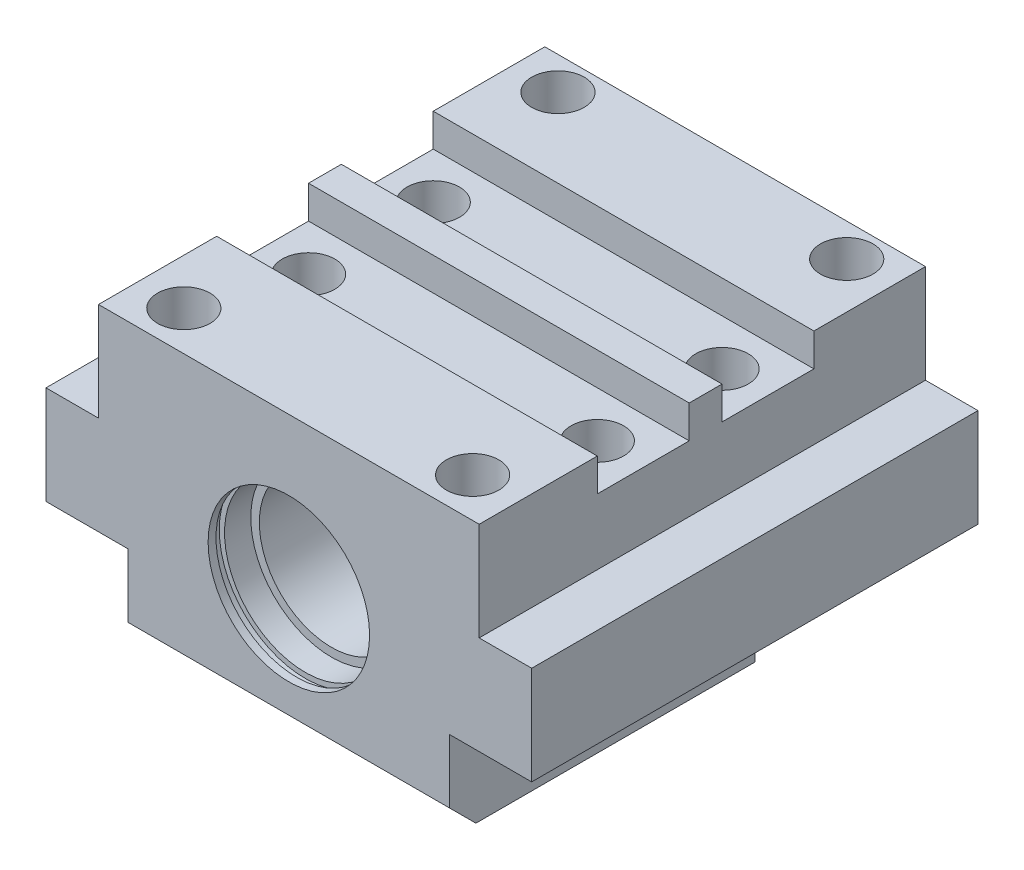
ISO-10303-21;
HEADER;
FILE_DESCRIPTION(('STEP AP214'),'2;1');
FILE_NAME('part.step','',(''),(''),'','','');
FILE_SCHEMA(('AUTOMOTIVE_DESIGN { 1 0 10303 214 1 1 1 1 }'));
ENDSEC;
DATA;
#1=APPLICATION_CONTEXT('core data for automotive mechanical design processes');
#2=APPLICATION_PROTOCOL_DEFINITION('international standard','automotive_design',2000,#1);
#3=PRODUCT_CONTEXT('',#1,'mechanical');
#4=PRODUCT('Part','Part','',(#3));
#5=PRODUCT_RELATED_PRODUCT_CATEGORY('part','',(#4));
#6=PRODUCT_DEFINITION_FORMATION('','',#4);
#7=PRODUCT_DEFINITION_CONTEXT('part definition',#1,'design');
#8=PRODUCT_DEFINITION('design','',#6,#7);
#9=PRODUCT_DEFINITION_SHAPE('','',#8);
#10=(LENGTH_UNIT() NAMED_UNIT(*) SI_UNIT(.MILLI.,.METRE.));
#11=(NAMED_UNIT(*) PLANE_ANGLE_UNIT() SI_UNIT($,.RADIAN.));
#12=(NAMED_UNIT(*) SI_UNIT($,.STERADIAN.) SOLID_ANGLE_UNIT());
#13=UNCERTAINTY_MEASURE_WITH_UNIT(LENGTH_MEASURE(1.E-05),#10,'distance_accuracy_value','');
#14=(GEOMETRIC_REPRESENTATION_CONTEXT(3) GLOBAL_UNCERTAINTY_ASSIGNED_CONTEXT((#13)) GLOBAL_UNIT_ASSIGNED_CONTEXT((#10,
#11,#12)) REPRESENTATION_CONTEXT('',''));
#15=CARTESIAN_POINT('',(0.,0.,0.));
#16=DIRECTION('',(0.,0.,1.));
#17=DIRECTION('',(1.,0.,0.));
#18=AXIS2_PLACEMENT_3D('',#15,#16,#17);
#19=CARTESIAN_POINT('',(-29.,0.,34.));
#20=DIRECTION('',(0.,-1.,0.));
#21=DIRECTION('',(1.,0.,0.));
#22=AXIS2_PLACEMENT_3D('',#19,#20,#21);
#23=PLANE('',#22);
#24=CARTESIAN_POINT('',(22.,0.,28.));
#25=DIRECTION('',(0.,1.,0.));
#26=DIRECTION('',(-1.,0.,0.));
#27=AXIS2_PLACEMENT_3D('',#24,#25,#26);
#28=CIRCLE('',#27,4.);
#29=CARTESIAN_POINT('',(18.,0.,28.));
#30=VERTEX_POINT('',#29);
#31=EDGE_CURVE('E616',#30,#30,#28,.T.);
#32=ORIENTED_EDGE('',*,*,#31,.F.);
#33=EDGE_LOOP('',(#32));
#34=FACE_BOUND('',#33,.T.);
#35=CARTESIAN_POINT('',(-22.,0.,28.));
#36=DIRECTION('',(0.,1.,0.));
#37=DIRECTION('',(-1.,0.,0.));
#38=AXIS2_PLACEMENT_3D('',#35,#36,#37);
#39=CIRCLE('',#38,4.);
#40=CARTESIAN_POINT('',(-26.,0.,28.));
#41=VERTEX_POINT('',#40);
#42=EDGE_CURVE('E622',#41,#41,#39,.T.);
#43=ORIENTED_EDGE('',*,*,#42,.F.);
#44=EDGE_LOOP('',(#43));
#45=FACE_BOUND('',#44,.T.);
#46=DIRECTION('',(0.,0.,-1.));
#47=VECTOR('',#46,1.);
#48=CARTESIAN_POINT('',(-29.,0.,34.));
#49=LINE('',#48,#47);
#50=CARTESIAN_POINT('',(-29.,0.,16.));
#51=VERTEX_POINT('',#50);
#52=CARTESIAN_POINT('',(-29.,0.,34.));
#53=VERTEX_POINT('',#52);
#54=EDGE_CURVE('E201',#51,#53,#49,.F.);
#55=ORIENTED_EDGE('',*,*,#54,.T.);
#56=DIRECTION('',(1.,0.,0.));
#57=VECTOR('',#56,1.);
#58=CARTESIAN_POINT('',(-29.,0.,34.));
#59=LINE('',#58,#57);
#60=CARTESIAN_POINT('',(29.,0.,34.));
#61=VERTEX_POINT('',#60);
#62=EDGE_CURVE('E258',#61,#53,#59,.F.);
#63=ORIENTED_EDGE('',*,*,#62,.F.);
#64=DIRECTION('',(0.,0.,-1.));
#65=VECTOR('',#64,1.);
#66=CARTESIAN_POINT('',(29.,0.,34.));
#67=LINE('',#66,#65);
#68=CARTESIAN_POINT('',(29.,0.,16.));
#69=VERTEX_POINT('',#68);
#70=EDGE_CURVE('E219',#69,#61,#67,.F.);
#71=ORIENTED_EDGE('',*,*,#70,.F.);
#72=DIRECTION('',(1.,0.,0.));
#73=VECTOR('',#72,1.);
#74=CARTESIAN_POINT('',(-29.,0.,16.));
#75=LINE('',#74,#73);
#76=EDGE_CURVE('E221',#69,#51,#75,.F.);
#77=ORIENTED_EDGE('',*,*,#76,.T.);
#78=EDGE_LOOP('',(#55,#63,#71,#77));
#79=FACE_BOUND('',#78,.T.);
#80=ADVANCED_FACE('F17',(#34,#45,#79),#23,.F.);
#81=CARTESIAN_POINT('',(0.,0.,34.));
#82=DIRECTION('',(0.,0.,-1.));
#83=DIRECTION('',(-1.,0.,0.));
#84=AXIS2_PLACEMENT_3D('',#81,#82,#83);
#85=PLANE('',#84);
#86=DIRECTION('',(-1.,0.,0.));
#87=VECTOR('',#86,1.);
#88=CARTESIAN_POINT('',(0.,-15.,34.));
#89=LINE('',#88,#87);
#90=CARTESIAN_POINT('',(29.,-15.,34.));
#91=VERTEX_POINT('',#90);
#92=CARTESIAN_POINT('',(37.,-15.,34.));
#93=VERTEX_POINT('',#92);
#94=EDGE_CURVE('E237',#91,#93,#89,.F.);
#95=ORIENTED_EDGE('',*,*,#94,.F.);
#96=DIRECTION('',(0.,-1.,0.));
#97=VECTOR('',#96,1.);
#98=CARTESIAN_POINT('',(29.,0.,34.));
#99=LINE('',#98,#97);
#100=EDGE_CURVE('E302',#91,#61,#99,.F.);
#101=ORIENTED_EDGE('',*,*,#100,.T.);
#102=ORIENTED_EDGE('',*,*,#62,.T.);
#103=DIRECTION('',(0.,-1.,0.));
#104=VECTOR('',#103,1.);
#105=CARTESIAN_POINT('',(-29.,0.,34.));
#106=LINE('',#105,#104);
#107=CARTESIAN_POINT('',(-29.,-15.,34.));
#108=VERTEX_POINT('',#107);
#109=EDGE_CURVE('E293',#108,#53,#106,.F.);
#110=ORIENTED_EDGE('',*,*,#109,.F.);
#111=DIRECTION('',(1.,0.,0.));
#112=VECTOR('',#111,1.);
#113=CARTESIAN_POINT('',(-37.,-15.,34.));
#114=LINE('',#113,#112);
#115=CARTESIAN_POINT('',(-37.,-15.,34.));
#116=VERTEX_POINT('',#115);
#117=EDGE_CURVE('E251',#108,#116,#114,.F.);
#118=ORIENTED_EDGE('',*,*,#117,.T.);
#119=DIRECTION('',(0.,1.,0.));
#120=VECTOR('',#119,1.);
#121=CARTESIAN_POINT('',(-37.,-30.,34.));
#122=LINE('',#121,#120);
#123=CARTESIAN_POINT('',(-37.,-30.,34.));
#124=VERTEX_POINT('',#123);
#125=EDGE_CURVE('E296',#116,#124,#122,.F.);
#126=ORIENTED_EDGE('',*,*,#125,.T.);
#127=DIRECTION('',(1.,0.,0.));
#128=VECTOR('',#127,1.);
#129=CARTESIAN_POINT('',(0.,-30.,34.));
#130=LINE('',#129,#128);
#131=CARTESIAN_POINT('',(-24.5,-30.,34.));
#132=VERTEX_POINT('',#131);
#133=EDGE_CURVE('E254',#132,#124,#130,.F.);
#134=ORIENTED_EDGE('',*,*,#133,.F.);
#135=DIRECTION('',(0.,1.,0.));
#136=VECTOR('',#135,1.);
#137=CARTESIAN_POINT('',(-24.5,-43.7,34.));
#138=LINE('',#137,#136);
#139=CARTESIAN_POINT('',(-24.5,-39.7,34.));
#140=VERTEX_POINT('',#139);
#141=EDGE_CURVE('E299',#132,#140,#138,.F.);
#142=ORIENTED_EDGE('',*,*,#141,.T.);
#143=DIRECTION('',(1.,0.,0.));
#144=VECTOR('',#143,1.);
#145=CARTESIAN_POINT('',(0.,-39.7,34.));
#146=LINE('',#145,#144);
#147=CARTESIAN_POINT('',(24.5,-39.7,34.));
#148=VERTEX_POINT('',#147);
#149=EDGE_CURVE('E182',#140,#148,#146,.T.);
#150=ORIENTED_EDGE('',*,*,#149,.T.);
#151=DIRECTION('',(0.,1.,0.));
#152=VECTOR('',#151,1.);
#153=CARTESIAN_POINT('',(24.5,0.,34.));
#154=LINE('',#153,#152);
#155=CARTESIAN_POINT('',(24.5,-30.,34.));
#156=VERTEX_POINT('',#155);
#157=EDGE_CURVE('E192',#156,#148,#154,.F.);
#158=ORIENTED_EDGE('',*,*,#157,.F.);
#159=DIRECTION('',(-1.,0.,0.));
#160=VECTOR('',#159,1.);
#161=CARTESIAN_POINT('',(37.,-30.,34.));
#162=LINE('',#161,#160);
#163=CARTESIAN_POINT('',(37.,-30.,34.));
#164=VERTEX_POINT('',#163);
#165=EDGE_CURVE('E239',#156,#164,#162,.F.);
#166=ORIENTED_EDGE('',*,*,#165,.T.);
#167=DIRECTION('',(0.,1.,0.));
#168=VECTOR('',#167,1.);
#169=CARTESIAN_POINT('',(37.,0.,34.));
#170=LINE('',#169,#168);
#171=EDGE_CURVE('E305',#93,#164,#170,.F.);
#172=ORIENTED_EDGE('',*,*,#171,.F.);
#173=EDGE_LOOP('',(#95,#101,#102,#110,#118,#126,#134,#142,#150,#158,#166,#172));
#174=FACE_BOUND('',#173,.T.);
#175=CARTESIAN_POINT('',(0.,-23.,34.));
#176=DIRECTION('',(0.,0.,-1.));
#177=DIRECTION('',(-1.,0.,0.));
#178=AXIS2_PLACEMENT_3D('',#175,#176,#177);
#179=CIRCLE('',#178,12.3);
#180=CARTESIAN_POINT('',(-12.3,-23.,34.));
#181=VERTEX_POINT('',#180);
#182=EDGE_CURVE('E11',#181,#181,#179,.T.);
#183=ORIENTED_EDGE('',*,*,#182,.T.);
#184=EDGE_LOOP('',(#183));
#185=FACE_BOUND('',#184,.T.);
#186=ADVANCED_FACE('F465',(#174,#185),#85,.F.);
#187=CARTESIAN_POINT('',(-29.,0.,34.));
#188=DIRECTION('',(0.,-1.,0.));
#189=DIRECTION('',(1.,0.,0.));
#190=AXIS2_PLACEMENT_3D('',#187,#188,#189);
#191=PLANE('',#190);
#192=CARTESIAN_POINT('',(-22.,0.,-29.));
#193=DIRECTION('',(0.,1.,0.));
#194=DIRECTION('',(-1.,0.,0.));
#195=AXIS2_PLACEMENT_3D('',#192,#193,#194);
#196=CIRCLE('',#195,4.);
#197=CARTESIAN_POINT('',(-26.,0.,-29.));
#198=VERTEX_POINT('',#197);
#199=EDGE_CURVE('E654',#198,#198,#196,.T.);
#200=ORIENTED_EDGE('',*,*,#199,.F.);
#201=EDGE_LOOP('',(#200));
#202=FACE_BOUND('',#201,.T.);
#203=CARTESIAN_POINT('',(22.,0.,-29.));
#204=DIRECTION('',(0.,1.,0.));
#205=DIRECTION('',(-1.,0.,0.));
#206=AXIS2_PLACEMENT_3D('',#203,#204,#205);
#207=CIRCLE('',#206,4.);
#208=CARTESIAN_POINT('',(18.,0.,-29.));
#209=VERTEX_POINT('',#208);
#210=EDGE_CURVE('E661',#209,#209,#207,.T.);
#211=ORIENTED_EDGE('',*,*,#210,.F.);
#212=EDGE_LOOP('',(#211));
#213=FACE_BOUND('',#212,.T.);
#214=DIRECTION('',(0.,0.,-1.));
#215=VECTOR('',#214,1.);
#216=CARTESIAN_POINT('',(29.,0.,34.));
#217=LINE('',#216,#215);
#218=CARTESIAN_POINT('',(29.,0.,-34.));
#219=VERTEX_POINT('',#218);
#220=CARTESIAN_POINT('',(29.,0.,-17.));
#221=VERTEX_POINT('',#220);
#222=EDGE_CURVE('E346',#219,#221,#217,.F.);
#223=ORIENTED_EDGE('',*,*,#222,.F.);
#224=DIRECTION('',(1.,0.,0.));
#225=VECTOR('',#224,1.);
#226=CARTESIAN_POINT('',(-29.,0.,-34.));
#227=LINE('',#226,#225);
#228=CARTESIAN_POINT('',(-29.,0.,-34.));
#229=VERTEX_POINT('',#228);
#230=EDGE_CURVE('E232',#229,#219,#227,.T.);
#231=ORIENTED_EDGE('',*,*,#230,.F.);
#232=DIRECTION('',(0.,0.,-1.));
#233=VECTOR('',#232,1.);
#234=CARTESIAN_POINT('',(-29.,0.,34.));
#235=LINE('',#234,#233);
#236=CARTESIAN_POINT('',(-29.,0.,-17.));
#237=VERTEX_POINT('',#236);
#238=EDGE_CURVE('E207',#229,#237,#235,.F.);
#239=ORIENTED_EDGE('',*,*,#238,.T.);
#240=DIRECTION('',(-1.,0.,0.));
#241=VECTOR('',#240,1.);
#242=CARTESIAN_POINT('',(-29.,0.,-17.));
#243=LINE('',#242,#241);
#244=EDGE_CURVE('E229',#237,#221,#243,.F.);
#245=ORIENTED_EDGE('',*,*,#244,.T.);
#246=EDGE_LOOP('',(#223,#231,#239,#245));
#247=FACE_BOUND('',#246,.T.);
#248=ADVANCED_FACE('F433',(#202,#213,#247),#191,.F.);
#249=CARTESIAN_POINT('',(24.5,-43.7,34.));
#250=DIRECTION('',(0.,1.,0.));
#251=DIRECTION('',(-1.,0.,0.));
#252=AXIS2_PLACEMENT_3D('',#249,#250,#251);
#253=PLANE('',#252);
#254=DIRECTION('',(0.,0.,-1.));
#255=VECTOR('',#254,1.);
#256=CARTESIAN_POINT('',(-24.5,-43.7,34.));
#257=LINE('',#256,#255);
#258=CARTESIAN_POINT('',(-24.5,-43.7,-12.5));
#259=VERTEX_POINT('',#258);
#260=CARTESIAN_POINT('',(-24.5,-43.7,30.));
#261=VERTEX_POINT('',#260);
#262=EDGE_CURVE('E214',#259,#261,#257,.F.);
#263=ORIENTED_EDGE('',*,*,#262,.F.);
#264=DIRECTION('',(1.,0.,0.));
#265=VECTOR('',#264,1.);
#266=CARTESIAN_POINT('',(24.5,-43.7,-12.5));
#267=LINE('',#266,#265);
#268=CARTESIAN_POINT('',(24.5,-43.7,-12.5));
#269=VERTEX_POINT('',#268);
#270=EDGE_CURVE('E32',#269,#259,#267,.F.);
#271=ORIENTED_EDGE('',*,*,#270,.F.);
#272=DIRECTION('',(0.,0.,-1.));
#273=VECTOR('',#272,1.);
#274=CARTESIAN_POINT('',(24.5,-43.7,34.));
#275=LINE('',#274,#273);
#276=CARTESIAN_POINT('',(24.5,-43.7,30.));
#277=VERTEX_POINT('',#276);
#278=EDGE_CURVE('E184',#269,#277,#275,.F.);
#279=ORIENTED_EDGE('',*,*,#278,.T.);
#280=DIRECTION('',(-1.,0.,0.));
#281=VECTOR('',#280,1.);
#282=CARTESIAN_POINT('',(24.5,-43.7,30.));
#283=LINE('',#282,#281);
#284=EDGE_CURVE('E173',#261,#277,#283,.F.);
#285=ORIENTED_EDGE('',*,*,#284,.F.);
#286=EDGE_LOOP('',(#263,#271,#279,#285));
#287=FACE_BOUND('',#286,.T.);
#288=ADVANCED_FACE('F185',(#287),#253,.F.);
#289=CARTESIAN_POINT('',(24.5,-42.,-12.5));
#290=DIRECTION('',(0.,0.,1.));
#291=DIRECTION('',(1.,0.,0.));
#292=AXIS2_PLACEMENT_3D('',#289,#290,#291);
#293=PLANE('',#292);
#294=DIRECTION('',(1.,0.,0.));
#295=VECTOR('',#294,1.);
#296=CARTESIAN_POINT('',(24.5,-42.,-12.5));
#297=LINE('',#296,#295);
#298=CARTESIAN_POINT('',(24.5,-42.,-12.5));
#299=VERTEX_POINT('',#298);
#300=CARTESIAN_POINT('',(-24.5,-42.,-12.5));
#301=VERTEX_POINT('',#300);
#302=EDGE_CURVE('E40',#299,#301,#297,.F.);
#303=ORIENTED_EDGE('',*,*,#302,.F.);
#304=DIRECTION('',(0.,-1.,0.));
#305=VECTOR('',#304,1.);
#306=CARTESIAN_POINT('',(24.5,-42.,-12.5));
#307=LINE('',#306,#305);
#308=EDGE_CURVE('E321',#269,#299,#307,.F.);
#309=ORIENTED_EDGE('',*,*,#308,.F.);
#310=ORIENTED_EDGE('',*,*,#270,.T.);
#311=DIRECTION('',(0.,1.,0.));
#312=VECTOR('',#311,1.);
#313=CARTESIAN_POINT('',(-24.5,-42.,-12.5));
#314=LINE('',#313,#312);
#315=EDGE_CURVE('E269',#301,#259,#314,.F.);
#316=ORIENTED_EDGE('',*,*,#315,.F.);
#317=EDGE_LOOP('',(#303,#309,#310,#316));
#318=FACE_BOUND('',#317,.T.);
#319=ADVANCED_FACE('F516',(#318),#293,.F.);
#320=CARTESIAN_POINT('',(-29.,0.,34.));
#321=DIRECTION('',(0.,-1.,0.));
#322=DIRECTION('',(1.,0.,0.));
#323=AXIS2_PLACEMENT_3D('',#320,#321,#322);
#324=PLANE('',#323);
#325=DIRECTION('',(0.,0.,-1.));
#326=VECTOR('',#325,1.);
#327=CARTESIAN_POINT('',(29.,0.,34.));
#328=LINE('',#327,#326);
#329=CARTESIAN_POINT('',(29.,0.,-3.));
#330=VERTEX_POINT('',#329);
#331=CARTESIAN_POINT('',(29.,0.,2.));
#332=VERTEX_POINT('',#331);
#333=EDGE_CURVE('E181',#330,#332,#328,.F.);
#334=ORIENTED_EDGE('',*,*,#333,.F.);
#335=DIRECTION('',(-1.,0.,0.));
#336=VECTOR('',#335,1.);
#337=CARTESIAN_POINT('',(-29.,0.,-3.));
#338=LINE('',#337,#336);
#339=CARTESIAN_POINT('',(-29.,0.,-3.));
#340=VERTEX_POINT('',#339);
#341=EDGE_CURVE('E227',#340,#330,#338,.F.);
#342=ORIENTED_EDGE('',*,*,#341,.F.);
#343=DIRECTION('',(0.,0.,-1.));
#344=VECTOR('',#343,1.);
#345=CARTESIAN_POINT('',(-29.,0.,34.));
#346=LINE('',#345,#344);
#347=CARTESIAN_POINT('',(-29.,0.,2.));
#348=VERTEX_POINT('',#347);
#349=EDGE_CURVE('E204',#340,#348,#346,.F.);
#350=ORIENTED_EDGE('',*,*,#349,.T.);
#351=DIRECTION('',(-1.,0.,0.));
#352=VECTOR('',#351,1.);
#353=CARTESIAN_POINT('',(-29.,0.,2.));
#354=LINE('',#353,#352);
#355=EDGE_CURVE('E224',#348,#332,#354,.F.);
#356=ORIENTED_EDGE('',*,*,#355,.T.);
#357=EDGE_LOOP('',(#334,#342,#350,#356));
#358=FACE_BOUND('',#357,.T.);
#359=ADVANCED_FACE('F449',(#358),#324,.F.);
#360=CARTESIAN_POINT('',(0.,-39.7,34.));
#361=DIRECTION('',(0.,0.70710678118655,-0.707106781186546));
#362=DIRECTION('',(0.,0.707106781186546,0.70710678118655));
#363=AXIS2_PLACEMENT_3D('',#360,#361,#362);
#364=PLANE('',#363);
#365=ORIENTED_EDGE('',*,*,#149,.F.);
#366=DIRECTION('',(0.,-0.707106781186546,-0.70710678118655));
#367=VECTOR('',#366,1.);
#368=CARTESIAN_POINT('',(-24.5,-39.7,34.));
#369=LINE('',#368,#367);
#370=EDGE_CURVE('E179',#261,#140,#369,.F.);
#371=ORIENTED_EDGE('',*,*,#370,.F.);
#372=ORIENTED_EDGE('',*,*,#284,.T.);
#373=DIRECTION('',(0.,0.707106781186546,0.70710678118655));
#374=VECTOR('',#373,1.);
#375=CARTESIAN_POINT('',(24.5,-39.7,34.));
#376=LINE('',#375,#374);
#377=EDGE_CURVE('E177',#148,#277,#376,.F.);
#378=ORIENTED_EDGE('',*,*,#377,.F.);
#379=EDGE_LOOP('',(#365,#371,#372,#378));
#380=FACE_BOUND('',#379,.T.);
#381=ADVANCED_FACE('F175',(#380),#364,.F.);
#382=CARTESIAN_POINT('',(-29.,-5.,-3.));
#383=DIRECTION('',(0.,0.,1.));
#384=DIRECTION('',(1.,0.,0.));
#385=AXIS2_PLACEMENT_3D('',#382,#383,#384);
#386=PLANE('',#385);
#387=DIRECTION('',(1.,0.,0.));
#388=VECTOR('',#387,1.);
#389=CARTESIAN_POINT('',(0.,-5.,-3.));
#390=LINE('',#389,#388);
#391=CARTESIAN_POINT('',(-29.,-5.,-3.));
#392=VERTEX_POINT('',#391);
#393=CARTESIAN_POINT('',(29.,-5.,-2.99999999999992));
#394=VERTEX_POINT('',#393);
#395=EDGE_CURVE('E390',#392,#394,#390,.T.);
#396=ORIENTED_EDGE('',*,*,#395,.F.);
#397=DIRECTION('',(0.,-1.,0.));
#398=VECTOR('',#397,1.);
#399=CARTESIAN_POINT('',(-29.,-15.,-3.));
#400=LINE('',#399,#398);
#401=EDGE_CURVE('E284',#392,#340,#400,.F.);
#402=ORIENTED_EDGE('',*,*,#401,.T.);
#403=ORIENTED_EDGE('',*,*,#341,.T.);
#404=DIRECTION('',(0.,-1.,0.));
#405=VECTOR('',#404,1.);
#406=CARTESIAN_POINT('',(29.,-5.,-2.99999999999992));
#407=LINE('',#406,#405);
#408=EDGE_CURVE('E315',#394,#330,#407,.F.);
#409=ORIENTED_EDGE('',*,*,#408,.F.);
#410=EDGE_LOOP('',(#396,#402,#403,#409));
#411=FACE_BOUND('',#410,.T.);
#412=ADVANCED_FACE('F445',(#411),#386,.F.);
#413=CARTESIAN_POINT('',(-29.,-5.,2.));
#414=DIRECTION('',(0.,0.,-1.));
#415=DIRECTION('',(-1.,0.,0.));
#416=AXIS2_PLACEMENT_3D('',#413,#414,#415);
#417=PLANE('',#416);
#418=DIRECTION('',(1.,0.,0.));
#419=VECTOR('',#418,1.);
#420=CARTESIAN_POINT('',(0.,-5.,2.));
#421=LINE('',#420,#419);
#422=CARTESIAN_POINT('',(29.,-5.,2.00000000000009));
#423=VERTEX_POINT('',#422);
#424=CARTESIAN_POINT('',(-29.,-5.,2.));
#425=VERTEX_POINT('',#424);
#426=EDGE_CURVE('E396',#423,#425,#421,.F.);
#427=ORIENTED_EDGE('',*,*,#426,.F.);
#428=DIRECTION('',(0.,-1.,0.));
#429=VECTOR('',#428,1.);
#430=CARTESIAN_POINT('',(29.,0.,2.));
#431=LINE('',#430,#429);
#432=EDGE_CURVE('E312',#423,#332,#431,.F.);
#433=ORIENTED_EDGE('',*,*,#432,.T.);
#434=ORIENTED_EDGE('',*,*,#355,.F.);
#435=DIRECTION('',(0.,-1.,0.));
#436=VECTOR('',#435,1.);
#437=CARTESIAN_POINT('',(-29.,-5.,2.));
#438=LINE('',#437,#436);
#439=EDGE_CURVE('E287',#425,#348,#438,.F.);
#440=ORIENTED_EDGE('',*,*,#439,.F.);
#441=EDGE_LOOP('',(#427,#433,#434,#440));
#442=FACE_BOUND('',#441,.T.);
#443=ADVANCED_FACE('F452',(#442),#417,.F.);
#444=CARTESIAN_POINT('',(-29.,-5.,16.));
#445=DIRECTION('',(0.,0.,1.));
#446=DIRECTION('',(1.,0.,0.));
#447=AXIS2_PLACEMENT_3D('',#444,#445,#446);
#448=PLANE('',#447);
#449=DIRECTION('',(1.,0.,0.));
#450=VECTOR('',#449,1.);
#451=CARTESIAN_POINT('',(0.,-5.,16.));
#452=LINE('',#451,#450);
#453=CARTESIAN_POINT('',(-29.,-5.,16.));
#454=VERTEX_POINT('',#453);
#455=CARTESIAN_POINT('',(29.,-5.,16.));
#456=VERTEX_POINT('',#455);
#457=EDGE_CURVE('E394',#454,#456,#452,.T.);
#458=ORIENTED_EDGE('',*,*,#457,.F.);
#459=DIRECTION('',(0.,-1.,0.));
#460=VECTOR('',#459,1.);
#461=CARTESIAN_POINT('',(-29.,-15.,16.));
#462=LINE('',#461,#460);
#463=EDGE_CURVE('E290',#454,#51,#462,.F.);
#464=ORIENTED_EDGE('',*,*,#463,.T.);
#465=ORIENTED_EDGE('',*,*,#76,.F.);
#466=DIRECTION('',(0.,-1.,0.));
#467=VECTOR('',#466,1.);
#468=CARTESIAN_POINT('',(29.,-5.,16.));
#469=LINE('',#468,#467);
#470=EDGE_CURVE('E309',#456,#69,#469,.F.);
#471=ORIENTED_EDGE('',*,*,#470,.F.);
#472=EDGE_LOOP('',(#458,#464,#465,#471));
#473=FACE_BOUND('',#472,.T.);
#474=ADVANCED_FACE('F459',(#473),#448,.F.);
#475=CARTESIAN_POINT('',(-29.,-5.,-17.));
#476=DIRECTION('',(0.,0.,-1.));
#477=DIRECTION('',(-1.,0.,0.));
#478=AXIS2_PLACEMENT_3D('',#475,#476,#477);
#479=PLANE('',#478);
#480=DIRECTION('',(1.,0.,0.));
#481=VECTOR('',#480,1.);
#482=CARTESIAN_POINT('',(0.,-5.,-17.));
#483=LINE('',#482,#481);
#484=CARTESIAN_POINT('',(29.,-5.,-17.));
#485=VERTEX_POINT('',#484);
#486=CARTESIAN_POINT('',(-29.,-5.,-17.));
#487=VERTEX_POINT('',#486);
#488=EDGE_CURVE('E392',#485,#487,#483,.F.);
#489=ORIENTED_EDGE('',*,*,#488,.F.);
#490=DIRECTION('',(0.,-1.,0.));
#491=VECTOR('',#490,1.);
#492=CARTESIAN_POINT('',(29.,0.,-17.));
#493=LINE('',#492,#491);
#494=EDGE_CURVE('E318',#485,#221,#493,.F.);
#495=ORIENTED_EDGE('',*,*,#494,.T.);
#496=ORIENTED_EDGE('',*,*,#244,.F.);
#497=DIRECTION('',(0.,-1.,0.));
#498=VECTOR('',#497,1.);
#499=CARTESIAN_POINT('',(-29.,-5.,-17.));
#500=LINE('',#499,#498);
#501=EDGE_CURVE('E281',#487,#237,#500,.F.);
#502=ORIENTED_EDGE('',*,*,#501,.F.);
#503=EDGE_LOOP('',(#489,#495,#496,#502));
#504=FACE_BOUND('',#503,.T.);
#505=ADVANCED_FACE('F437',(#504),#479,.F.);
#506=CARTESIAN_POINT('',(-29.,-15.,34.));
#507=DIRECTION('',(1.,0.,0.));
#508=DIRECTION('',(0.,0.,-1.));
#509=AXIS2_PLACEMENT_3D('',#506,#507,#508);
#510=PLANE('',#509);
#511=DIRECTION('',(0.,0.,-1.));
#512=VECTOR('',#511,1.);
#513=CARTESIAN_POINT('',(-29.,-5.,34.));
#514=LINE('',#513,#512);
#515=EDGE_CURVE('E386',#487,#392,#514,.F.);
#516=ORIENTED_EDGE('',*,*,#515,.F.);
#517=ORIENTED_EDGE('',*,*,#501,.T.);
#518=ORIENTED_EDGE('',*,*,#238,.F.);
#519=DIRECTION('',(0.,1.,0.));
#520=VECTOR('',#519,1.);
#521=CARTESIAN_POINT('',(-29.,-15.,-34.));
#522=LINE('',#521,#520);
#523=CARTESIAN_POINT('',(-29.,-15.,-34.));
#524=VERTEX_POINT('',#523);
#525=EDGE_CURVE('E278',#524,#229,#522,.T.);
#526=ORIENTED_EDGE('',*,*,#525,.F.);
#527=DIRECTION('',(0.,0.,-1.));
#528=VECTOR('',#527,1.);
#529=CARTESIAN_POINT('',(-29.,-15.,34.));
#530=LINE('',#529,#528);
#531=EDGE_CURVE('E381',#108,#524,#530,.T.);
#532=ORIENTED_EDGE('',*,*,#531,.F.);
#533=ORIENTED_EDGE('',*,*,#109,.T.);
#534=ORIENTED_EDGE('',*,*,#54,.F.);
#535=ORIENTED_EDGE('',*,*,#463,.F.);
#536=DIRECTION('',(0.,0.,-1.));
#537=VECTOR('',#536,1.);
#538=CARTESIAN_POINT('',(-29.,-5.,34.));
#539=LINE('',#538,#537);
#540=EDGE_CURVE('E383',#425,#454,#539,.F.);
#541=ORIENTED_EDGE('',*,*,#540,.F.);
#542=ORIENTED_EDGE('',*,*,#439,.T.);
#543=ORIENTED_EDGE('',*,*,#349,.F.);
#544=ORIENTED_EDGE('',*,*,#401,.F.);
#545=EDGE_LOOP('',(#516,#517,#518,#526,#532,#533,#534,#535,#541,#542,#543,#544));
#546=FACE_BOUND('',#545,.T.);
#547=ADVANCED_FACE('F478',(#546),#510,.F.);
#548=CARTESIAN_POINT('',(-37.,-15.,34.));
#549=DIRECTION('',(0.,-1.,0.));
#550=DIRECTION('',(0.,0.,-1.));
#551=AXIS2_PLACEMENT_3D('',#548,#549,#550);
#552=PLANE('',#551);
#553=ORIENTED_EDGE('',*,*,#531,.T.);
#554=DIRECTION('',(-1.,0.,0.));
#555=VECTOR('',#554,1.);
#556=CARTESIAN_POINT('',(0.,-15.,-34.));
#557=LINE('',#556,#555);
#558=CARTESIAN_POINT('',(-37.,-15.,-34.));
#559=VERTEX_POINT('',#558);
#560=EDGE_CURVE('E248',#524,#559,#557,.T.);
#561=ORIENTED_EDGE('',*,*,#560,.T.);
#562=DIRECTION('',(0.,0.,1.));
#563=VECTOR('',#562,1.);
#564=CARTESIAN_POINT('',(-37.,-15.,34.));
#565=LINE('',#564,#563);
#566=EDGE_CURVE('E210',#116,#559,#565,.F.);
#567=ORIENTED_EDGE('',*,*,#566,.F.);
#568=ORIENTED_EDGE('',*,*,#117,.F.);
#569=EDGE_LOOP('',(#553,#561,#567,#568));
#570=FACE_BOUND('',#569,.T.);
#571=ADVANCED_FACE('F475',(#570),#552,.F.);
#572=CARTESIAN_POINT('',(-37.,-30.,34.));
#573=DIRECTION('',(1.,0.,0.));
#574=DIRECTION('',(0.,0.,-1.));
#575=AXIS2_PLACEMENT_3D('',#572,#573,#574);
#576=PLANE('',#575);
#577=ORIENTED_EDGE('',*,*,#566,.T.);
#578=DIRECTION('',(0.,1.,0.));
#579=VECTOR('',#578,1.);
#580=CARTESIAN_POINT('',(-37.,-30.,-34.));
#581=LINE('',#580,#579);
#582=CARTESIAN_POINT('',(-37.,-30.,-34.));
#583=VERTEX_POINT('',#582);
#584=EDGE_CURVE('E275',#583,#559,#581,.T.);
#585=ORIENTED_EDGE('',*,*,#584,.F.);
#586=DIRECTION('',(0.,0.,1.));
#587=VECTOR('',#586,1.);
#588=CARTESIAN_POINT('',(-37.,-30.,34.));
#589=LINE('',#588,#587);
#590=EDGE_CURVE('E212',#124,#583,#589,.F.);
#591=ORIENTED_EDGE('',*,*,#590,.F.);
#592=ORIENTED_EDGE('',*,*,#125,.F.);
#593=EDGE_LOOP('',(#577,#585,#591,#592));
#594=FACE_BOUND('',#593,.T.);
#595=ADVANCED_FACE('F472',(#594),#576,.F.);
#596=CARTESIAN_POINT('',(-24.5,-30.,34.));
#597=DIRECTION('',(0.,1.,0.));
#598=DIRECTION('',(-1.,0.,0.));
#599=AXIS2_PLACEMENT_3D('',#596,#597,#598);
#600=PLANE('',#599);
#601=DIRECTION('',(0.,0.,-1.));
#602=VECTOR('',#601,1.);
#603=CARTESIAN_POINT('',(-24.5,-30.,34.));
#604=LINE('',#603,#602);
#605=CARTESIAN_POINT('',(-24.5,-30.,-34.));
#606=VERTEX_POINT('',#605);
#607=EDGE_CURVE('E367',#606,#132,#604,.F.);
#608=ORIENTED_EDGE('',*,*,#607,.T.);
#609=ORIENTED_EDGE('',*,*,#133,.T.);
#610=ORIENTED_EDGE('',*,*,#590,.T.);
#611=DIRECTION('',(-1.,0.,0.));
#612=VECTOR('',#611,1.);
#613=CARTESIAN_POINT('',(-24.5,-30.,-34.));
#614=LINE('',#613,#612);
#615=EDGE_CURVE('E245',#606,#583,#614,.T.);
#616=ORIENTED_EDGE('',*,*,#615,.F.);
#617=EDGE_LOOP('',(#608,#609,#610,#616));
#618=FACE_BOUND('',#617,.T.);
#619=ADVANCED_FACE('F468',(#618),#600,.F.);
#620=CARTESIAN_POINT('',(-24.5,-43.7,34.));
#621=DIRECTION('',(1.,0.,0.));
#622=DIRECTION('',(0.,0.,-1.));
#623=AXIS2_PLACEMENT_3D('',#620,#621,#622);
#624=PLANE('',#623);
#625=DIRECTION('',(0.,0.,-1.));
#626=VECTOR('',#625,1.);
#627=CARTESIAN_POINT('',(-24.5,-42.,34.));
#628=LINE('',#627,#626);
#629=CARTESIAN_POINT('',(-24.5,-42.,-34.));
#630=VERTEX_POINT('',#629);
#631=EDGE_CURVE('E217',#301,#630,#628,.T.);
#632=ORIENTED_EDGE('',*,*,#631,.F.);
#633=ORIENTED_EDGE('',*,*,#315,.T.);
#634=ORIENTED_EDGE('',*,*,#262,.T.);
#635=ORIENTED_EDGE('',*,*,#370,.T.);
#636=ORIENTED_EDGE('',*,*,#141,.F.);
#637=ORIENTED_EDGE('',*,*,#607,.F.);
#638=DIRECTION('',(0.,-1.,0.));
#639=VECTOR('',#638,1.);
#640=CARTESIAN_POINT('',(-24.5,0.,-34.));
#641=LINE('',#640,#639);
#642=EDGE_CURVE('E272',#606,#630,#641,.T.);
#643=ORIENTED_EDGE('',*,*,#642,.T.);
#644=EDGE_LOOP('',(#632,#633,#634,#635,#636,#637,#643));
#645=FACE_BOUND('',#644,.T.);
#646=ADVANCED_FACE('F365',(#645),#624,.F.);
#647=CARTESIAN_POINT('',(0.,-42.,0.));
#648=DIRECTION('',(0.,-1.,0.));
#649=DIRECTION('',(0.,0.,-1.));
#650=AXIS2_PLACEMENT_3D('',#647,#648,#649);
#651=PLANE('',#650);
#652=DIRECTION('',(0.,0.,-1.));
#653=VECTOR('',#652,1.);
#654=CARTESIAN_POINT('',(24.5,-42.,0.));
#655=LINE('',#654,#653);
#656=CARTESIAN_POINT('',(24.5,-42.,-34.));
#657=VERTEX_POINT('',#656);
#658=EDGE_CURVE('E187',#299,#657,#655,.T.);
#659=ORIENTED_EDGE('',*,*,#658,.F.);
#660=ORIENTED_EDGE('',*,*,#302,.T.);
#661=ORIENTED_EDGE('',*,*,#631,.T.);
#662=DIRECTION('',(-1.,0.,0.));
#663=VECTOR('',#662,1.);
#664=CARTESIAN_POINT('',(0.,-42.,-34.));
#665=LINE('',#664,#663);
#666=EDGE_CURVE('E243',#630,#657,#665,.F.);
#667=ORIENTED_EDGE('',*,*,#666,.T.);
#668=EDGE_LOOP('',(#659,#660,#661,#667));
#669=FACE_BOUND('',#668,.T.);
#670=ADVANCED_FACE('F360',(#669),#651,.T.);
#671=CARTESIAN_POINT('',(24.5,-30.,34.));
#672=DIRECTION('',(-1.,0.,0.));
#673=DIRECTION('',(0.,0.,1.));
#674=AXIS2_PLACEMENT_3D('',#671,#672,#673);
#675=PLANE('',#674);
#676=ORIENTED_EDGE('',*,*,#308,.T.);
#677=ORIENTED_EDGE('',*,*,#658,.T.);
#678=DIRECTION('',(0.,-1.,0.));
#679=VECTOR('',#678,1.);
#680=CARTESIAN_POINT('',(24.5,-30.,-34.));
#681=LINE('',#680,#679);
#682=CARTESIAN_POINT('',(24.5,-30.,-34.));
#683=VERTEX_POINT('',#682);
#684=EDGE_CURVE('E260',#683,#657,#681,.T.);
#685=ORIENTED_EDGE('',*,*,#684,.F.);
#686=DIRECTION('',(0.,0.,1.));
#687=VECTOR('',#686,1.);
#688=CARTESIAN_POINT('',(24.5,-30.,34.));
#689=LINE('',#688,#687);
#690=EDGE_CURVE('E356',#156,#683,#689,.F.);
#691=ORIENTED_EDGE('',*,*,#690,.F.);
#692=ORIENTED_EDGE('',*,*,#157,.T.);
#693=ORIENTED_EDGE('',*,*,#377,.T.);
#694=ORIENTED_EDGE('',*,*,#278,.F.);
#695=EDGE_LOOP('',(#676,#677,#685,#691,#692,#693,#694));
#696=FACE_BOUND('',#695,.T.);
#697=ADVANCED_FACE('F190',(#696),#675,.F.);
#698=CARTESIAN_POINT('',(37.,-30.,34.));
#699=DIRECTION('',(0.,1.,0.));
#700=DIRECTION('',(-1.,0.,0.));
#701=AXIS2_PLACEMENT_3D('',#698,#699,#700);
#702=PLANE('',#701);
#703=ORIENTED_EDGE('',*,*,#690,.T.);
#704=DIRECTION('',(1.,0.,0.));
#705=VECTOR('',#704,1.);
#706=CARTESIAN_POINT('',(0.,-30.,-34.));
#707=LINE('',#706,#705);
#708=CARTESIAN_POINT('',(37.,-30.,-34.));
#709=VERTEX_POINT('',#708);
#710=EDGE_CURVE('E241',#683,#709,#707,.T.);
#711=ORIENTED_EDGE('',*,*,#710,.T.);
#712=DIRECTION('',(0.,0.,1.));
#713=VECTOR('',#712,1.);
#714=CARTESIAN_POINT('',(37.,-30.,34.));
#715=LINE('',#714,#713);
#716=EDGE_CURVE('E193',#164,#709,#715,.F.);
#717=ORIENTED_EDGE('',*,*,#716,.F.);
#718=ORIENTED_EDGE('',*,*,#165,.F.);
#719=EDGE_LOOP('',(#703,#711,#717,#718));
#720=FACE_BOUND('',#719,.T.);
#721=ADVANCED_FACE('F354',(#720),#702,.F.);
#722=CARTESIAN_POINT('',(37.,-15.,34.));
#723=DIRECTION('',(-1.,0.,0.));
#724=DIRECTION('',(0.,0.,1.));
#725=AXIS2_PLACEMENT_3D('',#722,#723,#724);
#726=PLANE('',#725);
#727=DIRECTION('',(0.,0.,1.));
#728=VECTOR('',#727,1.);
#729=CARTESIAN_POINT('',(37.,-15.,34.));
#730=LINE('',#729,#728);
#731=CARTESIAN_POINT('',(37.,-15.,-34.));
#732=VERTEX_POINT('',#731);
#733=EDGE_CURVE('E196',#93,#732,#730,.F.);
#734=ORIENTED_EDGE('',*,*,#733,.F.);
#735=ORIENTED_EDGE('',*,*,#171,.T.);
#736=ORIENTED_EDGE('',*,*,#716,.T.);
#737=DIRECTION('',(0.,1.,0.));
#738=VECTOR('',#737,1.);
#739=CARTESIAN_POINT('',(37.,0.,-34.));
#740=LINE('',#739,#738);
#741=EDGE_CURVE('E263',#709,#732,#740,.T.);
#742=ORIENTED_EDGE('',*,*,#741,.T.);
#743=EDGE_LOOP('',(#734,#735,#736,#742));
#744=FACE_BOUND('',#743,.T.);
#745=ADVANCED_FACE('F348',(#744),#726,.F.);
#746=CARTESIAN_POINT('',(29.,-15.,34.));
#747=DIRECTION('',(0.,-1.,0.));
#748=DIRECTION('',(1.,0.,0.));
#749=AXIS2_PLACEMENT_3D('',#746,#747,#748);
#750=PLANE('',#749);
#751=DIRECTION('',(0.,0.,1.));
#752=VECTOR('',#751,1.);
#753=CARTESIAN_POINT('',(29.,-15.,34.));
#754=LINE('',#753,#752);
#755=CARTESIAN_POINT('',(29.,-15.,-34.));
#756=VERTEX_POINT('',#755);
#757=EDGE_CURVE('E340',#91,#756,#754,.F.);
#758=ORIENTED_EDGE('',*,*,#757,.F.);
#759=ORIENTED_EDGE('',*,*,#94,.T.);
#760=ORIENTED_EDGE('',*,*,#733,.T.);
#761=DIRECTION('',(1.,0.,0.));
#762=VECTOR('',#761,1.);
#763=CARTESIAN_POINT('',(29.,-15.,-34.));
#764=LINE('',#763,#762);
#765=EDGE_CURVE('E235',#756,#732,#764,.T.);
#766=ORIENTED_EDGE('',*,*,#765,.F.);
#767=EDGE_LOOP('',(#758,#759,#760,#766));
#768=FACE_BOUND('',#767,.T.);
#769=ADVANCED_FACE('F339',(#768),#750,.F.);
#770=CARTESIAN_POINT('',(0.,-5.,0.));
#771=DIRECTION('',(0.,1.,0.));
#772=DIRECTION('',(0.,0.,1.));
#773=AXIS2_PLACEMENT_3D('',#770,#771,#772);
#774=PLANE('',#773);
#775=CARTESIAN_POINT('',(22.,-5.,-10.));
#776=DIRECTION('',(0.,1.,0.));
#777=DIRECTION('',(0.,0.,1.));
#778=AXIS2_PLACEMENT_3D('',#775,#776,#777);
#779=CIRCLE('',#778,4.);
#780=CARTESIAN_POINT('',(22.,-5.,-6.));
#781=VERTEX_POINT('',#780);
#782=EDGE_CURVE('E644',#781,#781,#779,.T.);
#783=ORIENTED_EDGE('',*,*,#782,.F.);
#784=EDGE_LOOP('',(#783));
#785=FACE_BOUND('',#784,.T.);
#786=CARTESIAN_POINT('',(-22.,-5.,-10.));
#787=DIRECTION('',(0.,1.,0.));
#788=DIRECTION('',(0.,0.,1.));
#789=AXIS2_PLACEMENT_3D('',#786,#787,#788);
#790=CIRCLE('',#789,4.);
#791=CARTESIAN_POINT('',(-22.,-5.,-6.));
#792=VERTEX_POINT('',#791);
#793=EDGE_CURVE('E648',#792,#792,#790,.T.);
#794=ORIENTED_EDGE('',*,*,#793,.F.);
#795=EDGE_LOOP('',(#794));
#796=FACE_BOUND('',#795,.T.);
#797=ORIENTED_EDGE('',*,*,#395,.T.);
#798=DIRECTION('',(0.,0.,1.));
#799=VECTOR('',#798,1.);
#800=CARTESIAN_POINT('',(29.,-5.,34.));
#801=LINE('',#800,#799);
#802=EDGE_CURVE('E375',#394,#485,#801,.F.);
#803=ORIENTED_EDGE('',*,*,#802,.T.);
#804=ORIENTED_EDGE('',*,*,#488,.T.);
#805=ORIENTED_EDGE('',*,*,#515,.T.);
#806=EDGE_LOOP('',(#797,#803,#804,#805));
#807=FACE_BOUND('',#806,.T.);
#808=ADVANCED_FACE('F440',(#785,#796,#807),#774,.T.);
#809=CARTESIAN_POINT('',(0.,-5.,19.));
#810=DIRECTION('',(0.,1.,0.));
#811=DIRECTION('',(0.,0.,1.));
#812=AXIS2_PLACEMENT_3D('',#809,#810,#811);
#813=PLANE('',#812);
#814=CARTESIAN_POINT('',(22.,-5.,9.));
#815=DIRECTION('',(0.,1.,0.));
#816=DIRECTION('',(0.,0.,1.));
#817=AXIS2_PLACEMENT_3D('',#814,#815,#816);
#818=CIRCLE('',#817,4.);
#819=CARTESIAN_POINT('',(22.,-5.,13.));
#820=VERTEX_POINT('',#819);
#821=EDGE_CURVE('E634',#820,#820,#818,.T.);
#822=ORIENTED_EDGE('',*,*,#821,.F.);
#823=EDGE_LOOP('',(#822));
#824=FACE_BOUND('',#823,.T.);
#825=CARTESIAN_POINT('',(-22.,-5.,9.));
#826=DIRECTION('',(0.,1.,0.));
#827=DIRECTION('',(0.,0.,1.));
#828=AXIS2_PLACEMENT_3D('',#825,#826,#827);
#829=CIRCLE('',#828,4.);
#830=CARTESIAN_POINT('',(-22.,-5.,13.));
#831=VERTEX_POINT('',#830);
#832=EDGE_CURVE('E619',#831,#831,#829,.T.);
#833=ORIENTED_EDGE('',*,*,#832,.F.);
#834=EDGE_LOOP('',(#833));
#835=FACE_BOUND('',#834,.T.);
#836=ORIENTED_EDGE('',*,*,#457,.T.);
#837=DIRECTION('',(0.,0.,1.));
#838=VECTOR('',#837,1.);
#839=CARTESIAN_POINT('',(29.,-5.,34.));
#840=LINE('',#839,#838);
#841=EDGE_CURVE('E378',#456,#423,#840,.F.);
#842=ORIENTED_EDGE('',*,*,#841,.T.);
#843=ORIENTED_EDGE('',*,*,#426,.T.);
#844=ORIENTED_EDGE('',*,*,#540,.T.);
#845=EDGE_LOOP('',(#836,#842,#843,#844));
#846=FACE_BOUND('',#845,.T.);
#847=ADVANCED_FACE('F454',(#824,#835,#846),#813,.T.);
#848=CARTESIAN_POINT('',(29.,0.,34.));
#849=DIRECTION('',(-1.,0.,0.));
#850=DIRECTION('',(0.,-1.,0.));
#851=AXIS2_PLACEMENT_3D('',#848,#849,#850);
#852=PLANE('',#851);
#853=ORIENTED_EDGE('',*,*,#841,.F.);
#854=ORIENTED_EDGE('',*,*,#470,.T.);
#855=ORIENTED_EDGE('',*,*,#70,.T.);
#856=ORIENTED_EDGE('',*,*,#100,.F.);
#857=ORIENTED_EDGE('',*,*,#757,.T.);
#858=DIRECTION('',(0.,1.,0.));
#859=VECTOR('',#858,1.);
#860=CARTESIAN_POINT('',(29.,0.,-34.));
#861=LINE('',#860,#859);
#862=EDGE_CURVE('E266',#756,#219,#861,.T.);
#863=ORIENTED_EDGE('',*,*,#862,.T.);
#864=ORIENTED_EDGE('',*,*,#222,.T.);
#865=ORIENTED_EDGE('',*,*,#494,.F.);
#866=ORIENTED_EDGE('',*,*,#802,.F.);
#867=ORIENTED_EDGE('',*,*,#408,.T.);
#868=ORIENTED_EDGE('',*,*,#333,.T.);
#869=ORIENTED_EDGE('',*,*,#432,.F.);
#870=EDGE_LOOP('',(#853,#854,#855,#856,#857,#863,#864,#865,#866,#867,#868,#869));
#871=FACE_BOUND('',#870,.T.);
#872=ADVANCED_FACE('F330',(#871),#852,.F.);
#873=CARTESIAN_POINT('',(0.,0.,-34.));
#874=DIRECTION('',(0.,0.,-1.));
#875=DIRECTION('',(-1.,0.,0.));
#876=AXIS2_PLACEMENT_3D('',#873,#874,#875);
#877=PLANE('',#876);
#878=CARTESIAN_POINT('',(-28.,-22.5,-34.));
#879=DIRECTION('',(0.,0.,-1.));
#880=DIRECTION('',(-1.,0.,0.));
#881=AXIS2_PLACEMENT_3D('',#878,#879,#880);
#882=CIRCLE('',#881,5.);
#883=CARTESIAN_POINT('',(-33.,-22.5,-34.));
#884=VERTEX_POINT('',#883);
#885=EDGE_CURVE('E671',#884,#884,#882,.T.);
#886=ORIENTED_EDGE('',*,*,#885,.F.);
#887=EDGE_LOOP('',(#886));
#888=FACE_BOUND('',#887,.T.);
#889=CARTESIAN_POINT('',(28.,-22.5,-34.));
#890=DIRECTION('',(0.,0.,-1.));
#891=DIRECTION('',(-1.,0.,0.));
#892=AXIS2_PLACEMENT_3D('',#889,#890,#891);
#893=CIRCLE('',#892,5.);
#894=CARTESIAN_POINT('',(23.,-22.5,-34.));
#895=VERTEX_POINT('',#894);
#896=EDGE_CURVE('E660',#895,#895,#893,.T.);
#897=ORIENTED_EDGE('',*,*,#896,.F.);
#898=EDGE_LOOP('',(#897));
#899=FACE_BOUND('',#898,.T.);
#900=CARTESIAN_POINT('',(0.,-23.,-34.));
#901=DIRECTION('',(0.,0.,-1.));
#902=DIRECTION('',(-1.,0.,0.));
#903=AXIS2_PLACEMENT_3D('',#900,#901,#902);
#904=CIRCLE('',#903,12.3);
#905=CARTESIAN_POINT('',(-12.3,-23.,-34.));
#906=VERTEX_POINT('',#905);
#907=EDGE_CURVE('E25',#906,#906,#904,.T.);
#908=ORIENTED_EDGE('',*,*,#907,.F.);
#909=EDGE_LOOP('',(#908));
#910=FACE_BOUND('',#909,.T.);
#911=ORIENTED_EDGE('',*,*,#862,.F.);
#912=ORIENTED_EDGE('',*,*,#765,.T.);
#913=ORIENTED_EDGE('',*,*,#741,.F.);
#914=ORIENTED_EDGE('',*,*,#710,.F.);
#915=ORIENTED_EDGE('',*,*,#684,.T.);
#916=ORIENTED_EDGE('',*,*,#666,.F.);
#917=ORIENTED_EDGE('',*,*,#642,.F.);
#918=ORIENTED_EDGE('',*,*,#615,.T.);
#919=ORIENTED_EDGE('',*,*,#584,.T.);
#920=ORIENTED_EDGE('',*,*,#560,.F.);
#921=ORIENTED_EDGE('',*,*,#525,.T.);
#922=ORIENTED_EDGE('',*,*,#230,.T.);
#923=EDGE_LOOP('',(#911,#912,#913,#914,#915,#916,#917,#918,#919,#920,#921,#922));
#924=FACE_BOUND('',#923,.T.);
#925=ADVANCED_FACE('F326',(#888,#899,#910,#924),#877,.T.);
#926=CARTESIAN_POINT('',(0.,-23.,-27.5));
#927=DIRECTION('',(0.,0.,-1.));
#928=DIRECTION('',(-1.,0.,0.));
#929=AXIS2_PLACEMENT_3D('',#926,#927,#928);
#930=PLANE('',#929);
#931=CARTESIAN_POINT('',(0.,-23.,-27.5));
#932=DIRECTION('',(0.,0.,-1.));
#933=DIRECTION('',(0.,1.,0.));
#934=AXIS2_PLACEMENT_3D('',#931,#932,#933);
#935=CIRCLE('',#934,11.);
#936=CARTESIAN_POINT('',(0.,-12.,-27.5));
#937=VERTEX_POINT('',#936);
#938=EDGE_CURVE('E641',#937,#937,#935,.T.);
#939=ORIENTED_EDGE('',*,*,#938,.F.);
#940=EDGE_LOOP('',(#939));
#941=FACE_BOUND('',#940,.T.);
#942=CARTESIAN_POINT('',(0.,-23.,-27.5));
#943=DIRECTION('',(0.,0.,-1.));
#944=DIRECTION('',(-1.,0.,0.));
#945=AXIS2_PLACEMENT_3D('',#942,#943,#944);
#946=CIRCLE('',#945,12.3);
#947=CARTESIAN_POINT('',(-12.3,-23.,-27.5));
#948=VERTEX_POINT('',#947);
#949=EDGE_CURVE('E424',#948,#948,#946,.T.);
#950=ORIENTED_EDGE('',*,*,#949,.T.);
#951=EDGE_LOOP('',(#950));
#952=FACE_BOUND('',#951,.T.);
#953=ADVANCED_FACE('F329',(#941,#952),#930,.T.);
#954=CARTESIAN_POINT('',(0.,-23.,-27.5));
#955=DIRECTION('',(0.,0.,-1.));
#956=DIRECTION('',(-1.,0.,0.));
#957=AXIS2_PLACEMENT_3D('',#954,#955,#956);
#958=CYLINDRICAL_SURFACE('',#957,12.3);
#959=ORIENTED_EDGE('',*,*,#949,.F.);
#960=EDGE_LOOP('',(#959));
#961=FACE_BOUND('',#960,.T.);
#962=CARTESIAN_POINT('',(0.,-23.,-31.5));
#963=DIRECTION('',(0.,0.,-1.));
#964=DIRECTION('',(-1.,0.,0.));
#965=AXIS2_PLACEMENT_3D('',#962,#963,#964);
#966=CIRCLE('',#965,12.3);
#967=CARTESIAN_POINT('',(-12.3,-23.,-31.5));
#968=VERTEX_POINT('',#967);
#969=EDGE_CURVE('E421',#968,#968,#966,.F.);
#970=ORIENTED_EDGE('',*,*,#969,.F.);
#971=EDGE_LOOP('',(#970));
#972=FACE_BOUND('',#971,.T.);
#973=ADVANCED_FACE('F732',(#961,#972),#958,.F.);
#974=CARTESIAN_POINT('',(0.,-23.,-31.5));
#975=DIRECTION('',(0.,0.,-1.));
#976=DIRECTION('',(-1.,0.,0.));
#977=AXIS2_PLACEMENT_3D('',#974,#975,#976);
#978=PLANE('',#977);
#979=ORIENTED_EDGE('',*,*,#969,.T.);
#980=EDGE_LOOP('',(#979));
#981=FACE_BOUND('',#980,.T.);
#982=CARTESIAN_POINT('',(0.,-23.,-31.5));
#983=DIRECTION('',(0.,0.,1.));
#984=DIRECTION('',(1.,0.,0.));
#985=AXIS2_PLACEMENT_3D('',#982,#983,#984);
#986=CIRCLE('',#985,13.1);
#987=CARTESIAN_POINT('',(13.1,-23.,-31.5));
#988=VERTEX_POINT('',#987);
#989=EDGE_CURVE('E415',#988,#988,#986,.F.);
#990=ORIENTED_EDGE('',*,*,#989,.T.);
#991=EDGE_LOOP('',(#990));
#992=FACE_BOUND('',#991,.T.);
#993=ADVANCED_FACE('F725',(#981,#992),#978,.T.);
#994=CARTESIAN_POINT('',(0.,-23.,-32.8));
#995=DIRECTION('',(0.,0.,1.));
#996=DIRECTION('',(1.,0.,0.));
#997=AXIS2_PLACEMENT_3D('',#994,#995,#996);
#998=CYLINDRICAL_SURFACE('',#997,13.1);
#999=ORIENTED_EDGE('',*,*,#989,.F.);
#1000=EDGE_LOOP('',(#999));
#1001=FACE_BOUND('',#1000,.T.);
#1002=CARTESIAN_POINT('',(0.,-23.,-32.8));
#1003=DIRECTION('',(0.,0.,1.));
#1004=DIRECTION('',(1.,0.,0.));
#1005=AXIS2_PLACEMENT_3D('',#1002,#1003,#1004);
#1006=CIRCLE('',#1005,13.1);
#1007=CARTESIAN_POINT('',(13.1,-23.,-32.8));
#1008=VERTEX_POINT('',#1007);
#1009=EDGE_CURVE('E409',#1008,#1008,#1006,.F.);
#1010=ORIENTED_EDGE('',*,*,#1009,.T.);
#1011=EDGE_LOOP('',(#1010));
#1012=FACE_BOUND('',#1011,.T.);
#1013=ADVANCED_FACE('F715',(#1001,#1012),#998,.F.);
#1014=CARTESIAN_POINT('',(0.,-23.,-32.8));
#1015=DIRECTION('',(0.,0.,-1.));
#1016=DIRECTION('',(-1.,0.,0.));
#1017=AXIS2_PLACEMENT_3D('',#1014,#1015,#1016);
#1018=PLANE('',#1017);
#1019=CARTESIAN_POINT('',(0.,-23.,-32.8));
#1020=DIRECTION('',(0.,0.,-1.));
#1021=DIRECTION('',(-1.,0.,0.));
#1022=AXIS2_PLACEMENT_3D('',#1019,#1020,#1021);
#1023=CIRCLE('',#1022,12.3);
#1024=CARTESIAN_POINT('',(-12.3,-23.,-32.8));
#1025=VERTEX_POINT('',#1024);
#1026=EDGE_CURVE('E403',#1025,#1025,#1023,.T.);
#1027=ORIENTED_EDGE('',*,*,#1026,.T.);
#1028=EDGE_LOOP('',(#1027));
#1029=FACE_BOUND('',#1028,.T.);
#1030=ORIENTED_EDGE('',*,*,#1009,.F.);
#1031=EDGE_LOOP('',(#1030));
#1032=FACE_BOUND('',#1031,.T.);
#1033=ADVANCED_FACE('F712',(#1029,#1032),#1018,.F.);
#1034=CARTESIAN_POINT('',(0.,-23.,-27.5));
#1035=DIRECTION('',(0.,0.,-1.));
#1036=DIRECTION('',(-1.,0.,0.));
#1037=AXIS2_PLACEMENT_3D('',#1034,#1035,#1036);
#1038=CYLINDRICAL_SURFACE('',#1037,12.3);
#1039=ORIENTED_EDGE('',*,*,#1026,.F.);
#1040=EDGE_LOOP('',(#1039));
#1041=FACE_BOUND('',#1040,.T.);
#1042=ORIENTED_EDGE('',*,*,#907,.T.);
#1043=EDGE_LOOP('',(#1042));
#1044=FACE_BOUND('',#1043,.T.);
#1045=ADVANCED_FACE('F19',(#1041,#1044),#1038,.F.);
#1046=CARTESIAN_POINT('',(0.,-23.,32.8));
#1047=DIRECTION('',(0.,0.,-1.));
#1048=DIRECTION('',(-1.,0.,0.));
#1049=AXIS2_PLACEMENT_3D('',#1046,#1047,#1048);
#1050=CYLINDRICAL_SURFACE('',#1049,13.1);
#1051=CARTESIAN_POINT('',(0.,-23.,31.5));
#1052=DIRECTION('',(0.,0.,-1.));
#1053=DIRECTION('',(-1.,0.,0.));
#1054=AXIS2_PLACEMENT_3D('',#1051,#1052,#1053);
#1055=CIRCLE('',#1054,13.1);
#1056=CARTESIAN_POINT('',(-13.1,-23.,31.5));
#1057=VERTEX_POINT('',#1056);
#1058=EDGE_CURVE('E406',#1057,#1057,#1055,.F.);
#1059=ORIENTED_EDGE('',*,*,#1058,.F.);
#1060=EDGE_LOOP('',(#1059));
#1061=FACE_BOUND('',#1060,.T.);
#1062=CARTESIAN_POINT('',(0.,-23.,32.8));
#1063=DIRECTION('',(0.,0.,-1.));
#1064=DIRECTION('',(-1.,0.,0.));
#1065=AXIS2_PLACEMENT_3D('',#1062,#1063,#1064);
#1066=CIRCLE('',#1065,13.1);
#1067=CARTESIAN_POINT('',(-13.1,-23.,32.8));
#1068=VERTEX_POINT('',#1067);
#1069=EDGE_CURVE('E398',#1068,#1068,#1066,.F.);
#1070=ORIENTED_EDGE('',*,*,#1069,.T.);
#1071=EDGE_LOOP('',(#1070));
#1072=FACE_BOUND('',#1071,.T.);
#1073=ADVANCED_FACE('F708',(#1061,#1072),#1050,.F.);
#1074=CARTESIAN_POINT('',(0.,-23.,32.8));
#1075=DIRECTION('',(0.,0.,1.));
#1076=DIRECTION('',(1.,0.,0.));
#1077=AXIS2_PLACEMENT_3D('',#1074,#1075,#1076);
#1078=PLANE('',#1077);
#1079=CARTESIAN_POINT('',(0.,-23.,32.8));
#1080=DIRECTION('',(0.,0.,1.));
#1081=DIRECTION('',(1.,0.,0.));
#1082=AXIS2_PLACEMENT_3D('',#1079,#1080,#1081);
#1083=CIRCLE('',#1082,12.3);
#1084=CARTESIAN_POINT('',(12.3,-23.,32.8));
#1085=VERTEX_POINT('',#1084);
#1086=EDGE_CURVE('E389',#1085,#1085,#1083,.T.);
#1087=ORIENTED_EDGE('',*,*,#1086,.T.);
#1088=EDGE_LOOP('',(#1087));
#1089=FACE_BOUND('',#1088,.T.);
#1090=ORIENTED_EDGE('',*,*,#1069,.F.);
#1091=EDGE_LOOP('',(#1090));
#1092=FACE_BOUND('',#1091,.T.);
#1093=ADVANCED_FACE('F697',(#1089,#1092),#1078,.F.);
#1094=CARTESIAN_POINT('',(0.,-23.,27.5));
#1095=DIRECTION('',(0.,0.,1.));
#1096=DIRECTION('',(1.,0.,0.));
#1097=AXIS2_PLACEMENT_3D('',#1094,#1095,#1096);
#1098=CYLINDRICAL_SURFACE('',#1097,12.3);
#1099=ORIENTED_EDGE('',*,*,#1086,.F.);
#1100=EDGE_LOOP('',(#1099));
#1101=FACE_BOUND('',#1100,.T.);
#1102=ORIENTED_EDGE('',*,*,#182,.F.);
#1103=EDGE_LOOP('',(#1102));
#1104=FACE_BOUND('',#1103,.T.);
#1105=ADVANCED_FACE('F721',(#1101,#1104),#1098,.F.);
#1106=CARTESIAN_POINT('',(0.,-23.,31.5));
#1107=DIRECTION('',(0.,0.,1.));
#1108=DIRECTION('',(1.,0.,0.));
#1109=AXIS2_PLACEMENT_3D('',#1106,#1107,#1108);
#1110=PLANE('',#1109);
#1111=CARTESIAN_POINT('',(0.,-23.,31.5));
#1112=DIRECTION('',(0.,0.,1.));
#1113=DIRECTION('',(1.,0.,0.));
#1114=AXIS2_PLACEMENT_3D('',#1111,#1112,#1113);
#1115=CIRCLE('',#1114,12.3);
#1116=CARTESIAN_POINT('',(12.3,-23.,31.5));
#1117=VERTEX_POINT('',#1116);
#1118=EDGE_CURVE('E412',#1117,#1117,#1115,.F.);
#1119=ORIENTED_EDGE('',*,*,#1118,.T.);
#1120=EDGE_LOOP('',(#1119));
#1121=FACE_BOUND('',#1120,.T.);
#1122=ORIENTED_EDGE('',*,*,#1058,.T.);
#1123=EDGE_LOOP('',(#1122));
#1124=FACE_BOUND('',#1123,.T.);
#1125=ADVANCED_FACE('F717',(#1121,#1124),#1110,.T.);
#1126=CARTESIAN_POINT('',(0.,-23.,27.5));
#1127=DIRECTION('',(0.,0.,1.));
#1128=DIRECTION('',(1.,0.,0.));
#1129=AXIS2_PLACEMENT_3D('',#1126,#1127,#1128);
#1130=CYLINDRICAL_SURFACE('',#1129,12.3);
#1131=CARTESIAN_POINT('',(0.,-23.,27.5));
#1132=DIRECTION('',(0.,0.,1.));
#1133=DIRECTION('',(1.,0.,0.));
#1134=AXIS2_PLACEMENT_3D('',#1131,#1132,#1133);
#1135=CIRCLE('',#1134,12.3);
#1136=CARTESIAN_POINT('',(12.3,-23.,27.5));
#1137=VERTEX_POINT('',#1136);
#1138=EDGE_CURVE('E418',#1137,#1137,#1135,.T.);
#1139=ORIENTED_EDGE('',*,*,#1138,.F.);
#1140=EDGE_LOOP('',(#1139));
#1141=FACE_BOUND('',#1140,.T.);
#1142=ORIENTED_EDGE('',*,*,#1118,.F.);
#1143=EDGE_LOOP('',(#1142));
#1144=FACE_BOUND('',#1143,.T.);
#1145=ADVANCED_FACE('F720',(#1141,#1144),#1130,.F.);
#1146=CARTESIAN_POINT('',(0.,-23.,27.5));
#1147=DIRECTION('',(0.,0.,1.));
#1148=DIRECTION('',(1.,0.,0.));
#1149=AXIS2_PLACEMENT_3D('',#1146,#1147,#1148);
#1150=PLANE('',#1149);
#1151=CARTESIAN_POINT('',(0.,-23.,27.5));
#1152=DIRECTION('',(0.,0.,1.));
#1153=DIRECTION('',(1.,0.,0.));
#1154=AXIS2_PLACEMENT_3D('',#1151,#1152,#1153);
#1155=CIRCLE('',#1154,11.);
#1156=CARTESIAN_POINT('',(11.,-23.,27.5));
#1157=VERTEX_POINT('',#1156);
#1158=EDGE_CURVE('E633',#1157,#1157,#1155,.T.);
#1159=ORIENTED_EDGE('',*,*,#1158,.F.);
#1160=EDGE_LOOP('',(#1159));
#1161=FACE_BOUND('',#1160,.T.);
#1162=ORIENTED_EDGE('',*,*,#1138,.T.);
#1163=EDGE_LOOP('',(#1162));
#1164=FACE_BOUND('',#1163,.T.);
#1165=ADVANCED_FACE('F541',(#1161,#1164),#1150,.T.);
#1166=CARTESIAN_POINT('',(-28.,-22.5,-14.));
#1167=DIRECTION('',(0.,0.,-1.));
#1168=DIRECTION('',(-1.,0.,0.));
#1169=AXIS2_PLACEMENT_3D('',#1166,#1167,#1168);
#1170=PLANE('',#1169);
#1171=CARTESIAN_POINT('',(-28.,-22.5,-14.));
#1172=DIRECTION('',(0.,0.,-1.));
#1173=DIRECTION('',(-1.,0.,0.));
#1174=AXIS2_PLACEMENT_3D('',#1171,#1172,#1173);
#1175=CIRCLE('',#1174,5.);
#1176=CARTESIAN_POINT('',(-33.,-22.5,-14.));
#1177=VERTEX_POINT('',#1176);
#1178=EDGE_CURVE('E427',#1177,#1177,#1175,.T.);
#1179=ORIENTED_EDGE('',*,*,#1178,.T.);
#1180=EDGE_LOOP('',(#1179));
#1181=FACE_BOUND('',#1180,.T.);
#1182=ADVANCED_FACE('F537',(#1181),#1170,.T.);
#1183=CARTESIAN_POINT('',(-28.,-22.5,-14.));
#1184=DIRECTION('',(0.,0.,-1.));
#1185=DIRECTION('',(-1.,0.,0.));
#1186=AXIS2_PLACEMENT_3D('',#1183,#1184,#1185);
#1187=CYLINDRICAL_SURFACE('',#1186,5.);
#1188=ORIENTED_EDGE('',*,*,#885,.T.);
#1189=EDGE_LOOP('',(#1188));
#1190=FACE_BOUND('',#1189,.T.);
#1191=ORIENTED_EDGE('',*,*,#1178,.F.);
#1192=EDGE_LOOP('',(#1191));
#1193=FACE_BOUND('',#1192,.T.);
#1194=ADVANCED_FACE('F533',(#1190,#1193),#1187,.F.);
#1195=CARTESIAN_POINT('',(28.,-22.5,-14.));
#1196=DIRECTION('',(0.,0.,-1.));
#1197=DIRECTION('',(-1.,0.,0.));
#1198=AXIS2_PLACEMENT_3D('',#1195,#1196,#1197);
#1199=PLANE('',#1198);
#1200=CARTESIAN_POINT('',(28.,-22.5,-14.));
#1201=DIRECTION('',(0.,0.,-1.));
#1202=DIRECTION('',(-1.,0.,0.));
#1203=AXIS2_PLACEMENT_3D('',#1200,#1201,#1202);
#1204=CIRCLE('',#1203,5.);
#1205=CARTESIAN_POINT('',(23.,-22.5,-14.));
#1206=VERTEX_POINT('',#1205);
#1207=EDGE_CURVE('E674',#1206,#1206,#1204,.T.);
#1208=ORIENTED_EDGE('',*,*,#1207,.T.);
#1209=EDGE_LOOP('',(#1208));
#1210=FACE_BOUND('',#1209,.T.);
#1211=ADVANCED_FACE('F529',(#1210),#1199,.T.);
#1212=CARTESIAN_POINT('',(28.,-22.5,-14.));
#1213=DIRECTION('',(0.,0.,-1.));
#1214=DIRECTION('',(-1.,0.,0.));
#1215=AXIS2_PLACEMENT_3D('',#1212,#1213,#1214);
#1216=CYLINDRICAL_SURFACE('',#1215,5.);
#1217=ORIENTED_EDGE('',*,*,#896,.T.);
#1218=EDGE_LOOP('',(#1217));
#1219=FACE_BOUND('',#1218,.T.);
#1220=ORIENTED_EDGE('',*,*,#1207,.F.);
#1221=EDGE_LOOP('',(#1220));
#1222=FACE_BOUND('',#1221,.T.);
#1223=ADVANCED_FACE('F525',(#1219,#1222),#1216,.F.);
#1224=CARTESIAN_POINT('',(-22.,-16.,-29.));
#1225=DIRECTION('',(0.,1.,0.));
#1226=DIRECTION('',(-1.,0.,0.));
#1227=AXIS2_PLACEMENT_3D('',#1224,#1225,#1226);
#1228=PLANE('',#1227);
#1229=CARTESIAN_POINT('',(-22.,-16.,-29.));
#1230=DIRECTION('',(0.,1.,0.));
#1231=DIRECTION('',(-1.,0.,0.));
#1232=AXIS2_PLACEMENT_3D('',#1229,#1230,#1231);
#1233=CIRCLE('',#1232,4.);
#1234=CARTESIAN_POINT('',(-26.,-16.,-29.));
#1235=VERTEX_POINT('',#1234);
#1236=EDGE_CURVE('E664',#1235,#1235,#1233,.T.);
#1237=ORIENTED_EDGE('',*,*,#1236,.T.);
#1238=EDGE_LOOP('',(#1237));
#1239=FACE_BOUND('',#1238,.T.);
#1240=ADVANCED_FACE('F528',(#1239),#1228,.T.);
#1241=CARTESIAN_POINT('',(-22.,-16.,-29.));
#1242=DIRECTION('',(0.,1.,0.));
#1243=DIRECTION('',(-1.,0.,0.));
#1244=AXIS2_PLACEMENT_3D('',#1241,#1242,#1243);
#1245=CYLINDRICAL_SURFACE('',#1244,4.);
#1246=ORIENTED_EDGE('',*,*,#1236,.F.);
#1247=EDGE_LOOP('',(#1246));
#1248=FACE_BOUND('',#1247,.T.);
#1249=ORIENTED_EDGE('',*,*,#199,.T.);
#1250=EDGE_LOOP('',(#1249));
#1251=FACE_BOUND('',#1250,.T.);
#1252=ADVANCED_FACE('F543',(#1248,#1251),#1245,.F.);
#1253=CARTESIAN_POINT('',(22.,-16.,-29.));
#1254=DIRECTION('',(0.,1.,0.));
#1255=DIRECTION('',(-1.,0.,0.));
#1256=AXIS2_PLACEMENT_3D('',#1253,#1254,#1255);
#1257=PLANE('',#1256);
#1258=CARTESIAN_POINT('',(22.,-16.,-29.));
#1259=DIRECTION('',(0.,1.,0.));
#1260=DIRECTION('',(-1.,0.,0.));
#1261=AXIS2_PLACEMENT_3D('',#1258,#1259,#1260);
#1262=CIRCLE('',#1261,4.);
#1263=CARTESIAN_POINT('',(18.,-16.,-29.));
#1264=VERTEX_POINT('',#1263);
#1265=EDGE_CURVE('E657',#1264,#1264,#1262,.T.);
#1266=ORIENTED_EDGE('',*,*,#1265,.T.);
#1267=EDGE_LOOP('',(#1266));
#1268=FACE_BOUND('',#1267,.T.);
#1269=ADVANCED_FACE('F546',(#1268),#1257,.T.);
#1270=CARTESIAN_POINT('',(22.,-16.,-29.));
#1271=DIRECTION('',(0.,1.,0.));
#1272=DIRECTION('',(-1.,0.,0.));
#1273=AXIS2_PLACEMENT_3D('',#1270,#1271,#1272);
#1274=CYLINDRICAL_SURFACE('',#1273,4.);
#1275=ORIENTED_EDGE('',*,*,#1265,.F.);
#1276=EDGE_LOOP('',(#1275));
#1277=FACE_BOUND('',#1276,.T.);
#1278=ORIENTED_EDGE('',*,*,#210,.T.);
#1279=EDGE_LOOP('',(#1278));
#1280=FACE_BOUND('',#1279,.T.);
#1281=ADVANCED_FACE('F551',(#1277,#1280),#1274,.F.);
#1282=CARTESIAN_POINT('',(-22.,-21.,-10.));
#1283=DIRECTION('',(0.,1.,0.));
#1284=DIRECTION('',(0.,0.,1.));
#1285=AXIS2_PLACEMENT_3D('',#1282,#1283,#1284);
#1286=PLANE('',#1285);
#1287=CARTESIAN_POINT('',(-22.,-21.,-10.));
#1288=DIRECTION('',(0.,1.,0.));
#1289=DIRECTION('',(0.,0.,1.));
#1290=AXIS2_PLACEMENT_3D('',#1287,#1288,#1289);
#1291=CIRCLE('',#1290,4.);
#1292=CARTESIAN_POINT('',(-22.,-21.,-6.));
#1293=VERTEX_POINT('',#1292);
#1294=EDGE_CURVE('E651',#1293,#1293,#1291,.T.);
#1295=ORIENTED_EDGE('',*,*,#1294,.T.);
#1296=EDGE_LOOP('',(#1295));
#1297=FACE_BOUND('',#1296,.T.);
#1298=ADVANCED_FACE('F554',(#1297),#1286,.T.);
#1299=CARTESIAN_POINT('',(-22.,-21.,-10.));
#1300=DIRECTION('',(0.,1.,0.));
#1301=DIRECTION('',(0.,0.,1.));
#1302=AXIS2_PLACEMENT_3D('',#1299,#1300,#1301);
#1303=CYLINDRICAL_SURFACE('',#1302,4.);
#1304=ORIENTED_EDGE('',*,*,#1294,.F.);
#1305=EDGE_LOOP('',(#1304));
#1306=FACE_BOUND('',#1305,.T.);
#1307=ORIENTED_EDGE('',*,*,#793,.T.);
#1308=EDGE_LOOP('',(#1307));
#1309=FACE_BOUND('',#1308,.T.);
#1310=ADVANCED_FACE('F559',(#1306,#1309),#1303,.F.);
#1311=CARTESIAN_POINT('',(22.,-21.,-10.));
#1312=DIRECTION('',(0.,1.,0.));
#1313=DIRECTION('',(0.,0.,1.));
#1314=AXIS2_PLACEMENT_3D('',#1311,#1312,#1313);
#1315=PLANE('',#1314);
#1316=CARTESIAN_POINT('',(22.,-21.,-10.));
#1317=DIRECTION('',(0.,1.,0.));
#1318=DIRECTION('',(0.,0.,1.));
#1319=AXIS2_PLACEMENT_3D('',#1316,#1317,#1318);
#1320=CIRCLE('',#1319,4.);
#1321=CARTESIAN_POINT('',(22.,-21.,-6.));
#1322=VERTEX_POINT('',#1321);
#1323=EDGE_CURVE('E645',#1322,#1322,#1320,.T.);
#1324=ORIENTED_EDGE('',*,*,#1323,.T.);
#1325=EDGE_LOOP('',(#1324));
#1326=FACE_BOUND('',#1325,.T.);
#1327=ADVANCED_FACE('F562',(#1326),#1315,.T.);
#1328=CARTESIAN_POINT('',(22.,-21.,-10.));
#1329=DIRECTION('',(0.,1.,0.));
#1330=DIRECTION('',(0.,0.,1.));
#1331=AXIS2_PLACEMENT_3D('',#1328,#1329,#1330);
#1332=CYLINDRICAL_SURFACE('',#1331,4.);
#1333=ORIENTED_EDGE('',*,*,#1323,.F.);
#1334=EDGE_LOOP('',(#1333));
#1335=FACE_BOUND('',#1334,.T.);
#1336=ORIENTED_EDGE('',*,*,#782,.T.);
#1337=EDGE_LOOP('',(#1336));
#1338=FACE_BOUND('',#1337,.T.);
#1339=ADVANCED_FACE('F567',(#1335,#1338),#1332,.F.);
#1340=CARTESIAN_POINT('',(0.,-23.,-34.));
#1341=DIRECTION('',(0.,0.,1.));
#1342=DIRECTION('',(1.,0.,0.));
#1343=AXIS2_PLACEMENT_3D('',#1340,#1341,#1342);
#1344=CYLINDRICAL_SURFACE('',#1343,11.);
#1345=ORIENTED_EDGE('',*,*,#938,.T.);
#1346=EDGE_LOOP('',(#1345));
#1347=FACE_BOUND('',#1346,.T.);
#1348=ORIENTED_EDGE('',*,*,#1158,.T.);
#1349=EDGE_LOOP('',(#1348));
#1350=FACE_BOUND('',#1349,.T.);
#1351=ADVANCED_FACE('F570',(#1347,#1350),#1344,.F.);
#1352=CARTESIAN_POINT('',(-22.,-21.,9.));
#1353=DIRECTION('',(0.,1.,0.));
#1354=DIRECTION('',(0.,0.,1.));
#1355=AXIS2_PLACEMENT_3D('',#1352,#1353,#1354);
#1356=CYLINDRICAL_SURFACE('',#1355,4.);
#1357=CARTESIAN_POINT('',(-22.,-21.,9.));
#1358=DIRECTION('',(0.,1.,0.));
#1359=DIRECTION('',(0.,0.,1.));
#1360=AXIS2_PLACEMENT_3D('',#1357,#1358,#1359);
#1361=CIRCLE('',#1360,4.);
#1362=CARTESIAN_POINT('',(-22.,-21.,13.));
#1363=VERTEX_POINT('',#1362);
#1364=EDGE_CURVE('E615',#1363,#1363,#1361,.T.);
#1365=ORIENTED_EDGE('',*,*,#1364,.F.);
#1366=EDGE_LOOP('',(#1365));
#1367=FACE_BOUND('',#1366,.T.);
#1368=ORIENTED_EDGE('',*,*,#832,.T.);
#1369=EDGE_LOOP('',(#1368));
#1370=FACE_BOUND('',#1369,.T.);
#1371=ADVANCED_FACE('F577',(#1367,#1370),#1356,.F.);
#1372=CARTESIAN_POINT('',(-22.,-21.,9.));
#1373=DIRECTION('',(0.,1.,0.));
#1374=DIRECTION('',(0.,0.,1.));
#1375=AXIS2_PLACEMENT_3D('',#1372,#1373,#1374);
#1376=PLANE('',#1375);
#1377=ORIENTED_EDGE('',*,*,#1364,.T.);
#1378=EDGE_LOOP('',(#1377));
#1379=FACE_BOUND('',#1378,.T.);
#1380=ADVANCED_FACE('F579',(#1379),#1376,.T.);
#1381=CARTESIAN_POINT('',(22.,-21.,9.));
#1382=DIRECTION('',(0.,1.,0.));
#1383=DIRECTION('',(0.,0.,1.));
#1384=AXIS2_PLACEMENT_3D('',#1381,#1382,#1383);
#1385=CYLINDRICAL_SURFACE('',#1384,4.);
#1386=CARTESIAN_POINT('',(22.,-21.,9.));
#1387=DIRECTION('',(0.,1.,0.));
#1388=DIRECTION('',(0.,0.,1.));
#1389=AXIS2_PLACEMENT_3D('',#1386,#1387,#1388);
#1390=CIRCLE('',#1389,4.);
#1391=CARTESIAN_POINT('',(22.,-21.,13.));
#1392=VERTEX_POINT('',#1391);
#1393=EDGE_CURVE('E630',#1392,#1392,#1390,.T.);
#1394=ORIENTED_EDGE('',*,*,#1393,.F.);
#1395=EDGE_LOOP('',(#1394));
#1396=FACE_BOUND('',#1395,.T.);
#1397=ORIENTED_EDGE('',*,*,#821,.T.);
#1398=EDGE_LOOP('',(#1397));
#1399=FACE_BOUND('',#1398,.T.);
#1400=ADVANCED_FACE('F582',(#1396,#1399),#1385,.F.);
#1401=CARTESIAN_POINT('',(22.,-21.,9.));
#1402=DIRECTION('',(0.,1.,0.));
#1403=DIRECTION('',(0.,0.,1.));
#1404=AXIS2_PLACEMENT_3D('',#1401,#1402,#1403);
#1405=PLANE('',#1404);
#1406=ORIENTED_EDGE('',*,*,#1393,.T.);
#1407=EDGE_LOOP('',(#1406));
#1408=FACE_BOUND('',#1407,.T.);
#1409=ADVANCED_FACE('F589',(#1408),#1405,.T.);
#1410=CARTESIAN_POINT('',(-22.,-16.,28.));
#1411=DIRECTION('',(0.,1.,0.));
#1412=DIRECTION('',(-1.,0.,0.));
#1413=AXIS2_PLACEMENT_3D('',#1410,#1411,#1412);
#1414=CYLINDRICAL_SURFACE('',#1413,4.);
#1415=CARTESIAN_POINT('',(-22.,-16.,28.));
#1416=DIRECTION('',(0.,1.,0.));
#1417=DIRECTION('',(-1.,0.,0.));
#1418=AXIS2_PLACEMENT_3D('',#1415,#1416,#1417);
#1419=CIRCLE('',#1418,4.);
#1420=CARTESIAN_POINT('',(-26.,-16.,28.));
#1421=VERTEX_POINT('',#1420);
#1422=EDGE_CURVE('E627',#1421,#1421,#1419,.T.);
#1423=ORIENTED_EDGE('',*,*,#1422,.F.);
#1424=EDGE_LOOP('',(#1423));
#1425=FACE_BOUND('',#1424,.T.);
#1426=ORIENTED_EDGE('',*,*,#42,.T.);
#1427=EDGE_LOOP('',(#1426));
#1428=FACE_BOUND('',#1427,.T.);
#1429=ADVANCED_FACE('F593',(#1425,#1428),#1414,.F.);
#1430=CARTESIAN_POINT('',(-22.,-16.,28.));
#1431=DIRECTION('',(0.,1.,0.));
#1432=DIRECTION('',(-1.,0.,0.));
#1433=AXIS2_PLACEMENT_3D('',#1430,#1431,#1432);
#1434=PLANE('',#1433);
#1435=ORIENTED_EDGE('',*,*,#1422,.T.);
#1436=EDGE_LOOP('',(#1435));
#1437=FACE_BOUND('',#1436,.T.);
#1438=ADVANCED_FACE('F595',(#1437),#1434,.T.);
#1439=CARTESIAN_POINT('',(22.,-16.,28.));
#1440=DIRECTION('',(0.,1.,0.));
#1441=DIRECTION('',(-1.,0.,0.));
#1442=AXIS2_PLACEMENT_3D('',#1439,#1440,#1441);
#1443=CYLINDRICAL_SURFACE('',#1442,4.);
#1444=CARTESIAN_POINT('',(22.,-16.,28.));
#1445=DIRECTION('',(0.,1.,0.));
#1446=DIRECTION('',(-1.,0.,0.));
#1447=AXIS2_PLACEMENT_3D('',#1444,#1445,#1446);
#1448=CIRCLE('',#1447,4.);
#1449=CARTESIAN_POINT('',(18.,-16.,28.));
#1450=VERTEX_POINT('',#1449);
#1451=EDGE_CURVE('E614',#1450,#1450,#1448,.T.);
#1452=ORIENTED_EDGE('',*,*,#1451,.F.);
#1453=EDGE_LOOP('',(#1452));
#1454=FACE_BOUND('',#1453,.T.);
#1455=ORIENTED_EDGE('',*,*,#31,.T.);
#1456=EDGE_LOOP('',(#1455));
#1457=FACE_BOUND('',#1456,.T.);
#1458=ADVANCED_FACE('F598',(#1454,#1457),#1443,.F.);
#1459=CARTESIAN_POINT('',(22.,-16.,28.));
#1460=DIRECTION('',(0.,1.,0.));
#1461=DIRECTION('',(-1.,0.,0.));
#1462=AXIS2_PLACEMENT_3D('',#1459,#1460,#1461);
#1463=PLANE('',#1462);
#1464=ORIENTED_EDGE('',*,*,#1451,.T.);
#1465=EDGE_LOOP('',(#1464));
#1466=FACE_BOUND('',#1465,.T.);
#1467=ADVANCED_FACE('F605',(#1466),#1463,.T.);
#1468=CLOSED_SHELL('',(#80,#186,#248,#288,#319,#359,#381,#412,#443,#474,#505,#547,#571,#595,
#619,#646,#670,#697,#721,#745,#769,#808,#847,#872,#925,#953,#973,#993,#1013,#1033,#1045,#1073,
#1093,#1105,#1125,#1145,#1165,#1182,#1194,#1211,#1223,#1240,#1252,#1269,#1281,#1298,#1310,#1327,
#1339,#1351,#1371,#1380,#1400,#1409,#1429,#1438,#1458,#1467));
#1469=MANIFOLD_SOLID_BREP('B1',#1468);
#1470=ADVANCED_BREP_SHAPE_REPRESENTATION('',(#18,#1469),#14);
#1471=SHAPE_DEFINITION_REPRESENTATION(#9,#1470);
ENDSEC;
END-ISO-10303-21;
